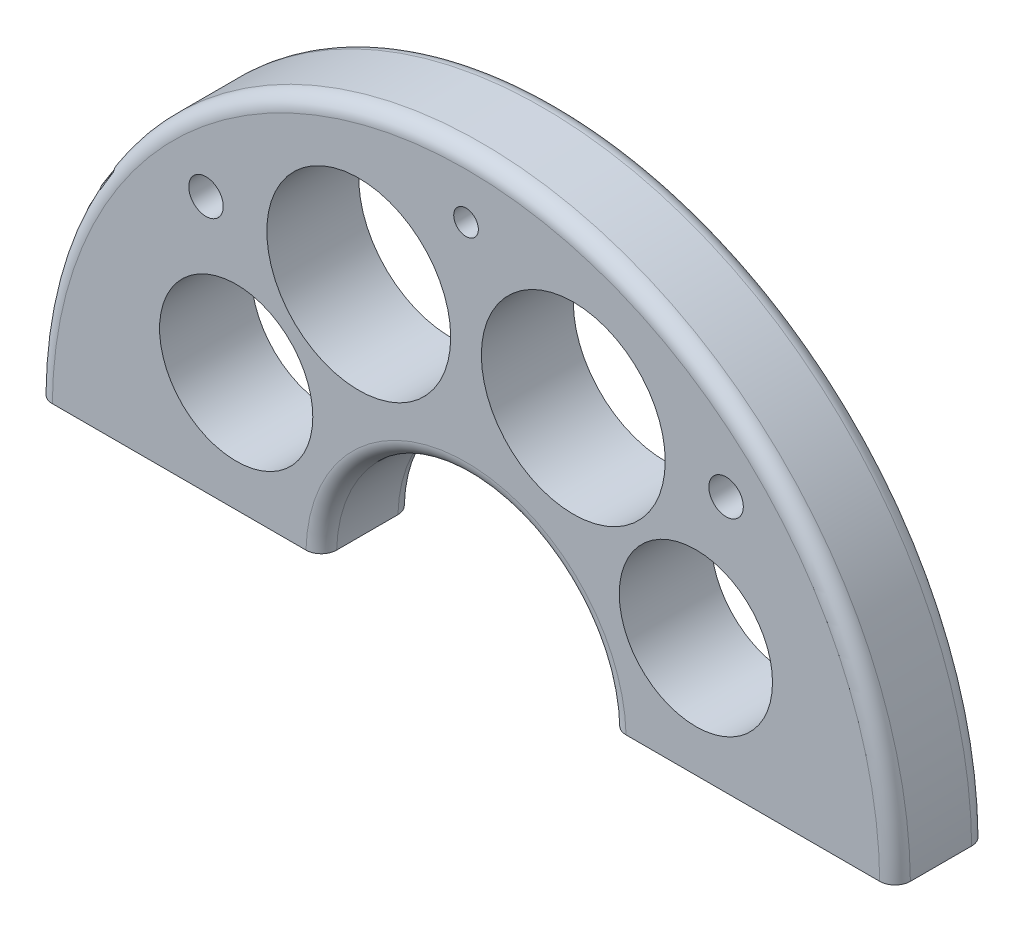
ISO-10303-21;
HEADER;
FILE_DESCRIPTION(('STEP AP214'),'2;1');
FILE_NAME('part.step','',(''),(''),'','','');
FILE_SCHEMA(('AUTOMOTIVE_DESIGN { 1 0 10303 214 1 1 1 1 }'));
ENDSEC;
DATA;
#1=APPLICATION_CONTEXT('core data for automotive mechanical design processes');
#2=APPLICATION_PROTOCOL_DEFINITION('international standard','automotive_design',2000,#1);
#3=PRODUCT_CONTEXT('',#1,'mechanical');
#4=PRODUCT('Part','Part','',(#3));
#5=PRODUCT_RELATED_PRODUCT_CATEGORY('part','',(#4));
#6=PRODUCT_DEFINITION_FORMATION('','',#4);
#7=PRODUCT_DEFINITION_CONTEXT('part definition',#1,'design');
#8=PRODUCT_DEFINITION('design','',#6,#7);
#9=PRODUCT_DEFINITION_SHAPE('','',#8);
#10=(LENGTH_UNIT() NAMED_UNIT(*) SI_UNIT(.MILLI.,.METRE.));
#11=(NAMED_UNIT(*) PLANE_ANGLE_UNIT() SI_UNIT($,.RADIAN.));
#12=(NAMED_UNIT(*) SI_UNIT($,.STERADIAN.) SOLID_ANGLE_UNIT());
#13=UNCERTAINTY_MEASURE_WITH_UNIT(LENGTH_MEASURE(1.E-05),#10,'distance_accuracy_value','');
#14=(GEOMETRIC_REPRESENTATION_CONTEXT(3) GLOBAL_UNCERTAINTY_ASSIGNED_CONTEXT((#13)) GLOBAL_UNIT_ASSIGNED_CONTEXT((#10,
#11,#12)) REPRESENTATION_CONTEXT('',''));
#15=CARTESIAN_POINT('',(0.,0.,0.));
#16=DIRECTION('',(0.,0.,1.));
#17=DIRECTION('',(1.,0.,0.));
#18=AXIS2_PLACEMENT_3D('',#15,#16,#17);
#19=CARTESIAN_POINT('',(0.,0.,9.525));
#20=DIRECTION('',(0.,0.,1.));
#21=DIRECTION('',(1.,0.,0.));
#22=AXIS2_PLACEMENT_3D('',#19,#20,#21);
#23=PLANE('',#22);
#24=CARTESIAN_POINT('',(-22.225,53.975,9.525));
#25=DIRECTION('',(0.,0.,1.));
#26=DIRECTION('',(1.,0.,0.));
#27=AXIS2_PLACEMENT_3D('',#24,#25,#26);
#28=CIRCLE('',#27,19.05);
#29=CARTESIAN_POINT('',(-3.175,53.975,9.525));
#30=VERTEX_POINT('',#29);
#31=EDGE_CURVE('E326',#30,#30,#28,.F.);
#32=ORIENTED_EDGE('',*,*,#31,.T.);
#33=EDGE_LOOP('',(#32));
#34=FACE_BOUND('',#33,.T.);
#35=CARTESIAN_POINT('',(-47.625,25.4,9.525));
#36=DIRECTION('',(0.,0.,1.));
#37=DIRECTION('',(1.,0.,0.));
#38=AXIS2_PLACEMENT_3D('',#35,#36,#37);
#39=CIRCLE('',#38,15.875);
#40=CARTESIAN_POINT('',(-31.75,25.4,9.525));
#41=VERTEX_POINT('',#40);
#42=EDGE_CURVE('E330',#41,#41,#39,.F.);
#43=ORIENTED_EDGE('',*,*,#42,.T.);
#44=EDGE_LOOP('',(#43));
#45=FACE_BOUND('',#44,.T.);
#46=CARTESIAN_POINT('',(22.225,53.975,9.525));
#47=DIRECTION('',(0.,0.,1.));
#48=DIRECTION('',(1.,0.,0.));
#49=AXIS2_PLACEMENT_3D('',#46,#47,#48);
#50=CIRCLE('',#49,19.05);
#51=CARTESIAN_POINT('',(41.275,53.975,9.525));
#52=VERTEX_POINT('',#51);
#53=EDGE_CURVE('E334',#52,#52,#50,.T.);
#54=ORIENTED_EDGE('',*,*,#53,.F.);
#55=EDGE_LOOP('',(#54));
#56=FACE_BOUND('',#55,.T.);
#57=CARTESIAN_POINT('',(47.625,25.4,9.525));
#58=DIRECTION('',(0.,0.,1.));
#59=DIRECTION('',(1.,0.,0.));
#60=AXIS2_PLACEMENT_3D('',#57,#58,#59);
#61=CIRCLE('',#60,15.875);
#62=CARTESIAN_POINT('',(63.5,25.4,9.525));
#63=VERTEX_POINT('',#62);
#64=EDGE_CURVE('E338',#63,#63,#61,.T.);
#65=ORIENTED_EDGE('',*,*,#64,.F.);
#66=EDGE_LOOP('',(#65));
#67=FACE_BOUND('',#66,.T.);
#68=CARTESIAN_POINT('',(0.,76.2,9.525));
#69=DIRECTION('',(0.,0.,1.));
#70=DIRECTION('',(1.,0.,0.));
#71=AXIS2_PLACEMENT_3D('',#68,#69,#70);
#72=CIRCLE('',#71,2.5527);
#73=CARTESIAN_POINT('',(2.5527,76.2,9.525));
#74=VERTEX_POINT('',#73);
#75=EDGE_CURVE('E125',#74,#74,#72,.T.);
#76=ORIENTED_EDGE('',*,*,#75,.F.);
#77=EDGE_LOOP('',(#76));
#78=FACE_BOUND('',#77,.T.);
#79=CARTESIAN_POINT('',(-53.8815367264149,53.8815367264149,9.525));
#80=DIRECTION('',(0.,0.,1.));
#81=DIRECTION('',(1.,0.,0.));
#82=AXIS2_PLACEMENT_3D('',#79,#80,#81);
#83=CIRCLE('',#82,3.57124);
#84=CARTESIAN_POINT('',(-50.3102967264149,53.8815367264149,9.525));
#85=VERTEX_POINT('',#84);
#86=EDGE_CURVE('E141',#85,#85,#83,.T.);
#87=ORIENTED_EDGE('',*,*,#86,.F.);
#88=EDGE_LOOP('',(#87));
#89=FACE_BOUND('',#88,.T.);
#90=CARTESIAN_POINT('',(53.8815367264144,53.8815367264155,9.525));
#91=DIRECTION('',(0.,0.,1.));
#92=DIRECTION('',(1.,0.,0.));
#93=AXIS2_PLACEMENT_3D('',#90,#91,#92);
#94=CIRCLE('',#93,3.57124);
#95=CARTESIAN_POINT('',(57.4527767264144,53.8815367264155,9.525));
#96=VERTEX_POINT('',#95);
#97=EDGE_CURVE('E145',#96,#96,#94,.T.);
#98=ORIENTED_EDGE('',*,*,#97,.F.);
#99=EDGE_LOOP('',(#98));
#100=FACE_BOUND('',#99,.T.);
#101=DIRECTION('',(1.,0.,0.));
#102=VECTOR('',#101,1.);
#103=CARTESIAN_POINT('',(0.,0.79375,9.525));
#104=LINE('',#103,#102);
#105=CARTESIAN_POINT('',(33.1655029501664,0.79375,9.525));
#106=VERTEX_POINT('',#105);
#107=CARTESIAN_POINT('',(85.7213251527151,0.79375,9.525));
#108=VERTEX_POINT('',#107);
#109=EDGE_CURVE('E140',#106,#108,#104,.T.);
#110=ORIENTED_EDGE('',*,*,#109,.T.);
#111=CARTESIAN_POINT('',(0.,0.,9.525));
#112=DIRECTION('',(0.,0.,1.));
#113=DIRECTION('',(1.,0.,0.));
#114=AXIS2_PLACEMENT_3D('',#111,#112,#113);
#115=CIRCLE('',#114,85.725);
#116=CARTESIAN_POINT('',(-85.7213251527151,0.79375,9.525));
#117=VERTEX_POINT('',#116);
#118=EDGE_CURVE('E303',#108,#117,#115,.T.);
#119=ORIENTED_EDGE('',*,*,#118,.T.);
#120=DIRECTION('',(1.,0.,0.));
#121=VECTOR('',#120,1.);
#122=CARTESIAN_POINT('',(0.,0.79375,9.525));
#123=LINE('',#122,#121);
#124=CARTESIAN_POINT('',(-33.1655029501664,0.79375,9.525));
#125=VERTEX_POINT('',#124);
#126=EDGE_CURVE('E160',#117,#125,#123,.T.);
#127=ORIENTED_EDGE('',*,*,#126,.T.);
#128=CARTESIAN_POINT('',(0.,0.,9.525));
#129=DIRECTION('',(0.,0.,1.));
#130=DIRECTION('',(1.,0.,0.));
#131=AXIS2_PLACEMENT_3D('',#128,#129,#130);
#132=CIRCLE('',#131,33.175);
#133=EDGE_CURVE('E306',#125,#106,#132,.F.);
#134=ORIENTED_EDGE('',*,*,#133,.T.);
#135=EDGE_LOOP('',(#110,#119,#127,#134));
#136=FACE_BOUND('',#135,.T.);
#137=ADVANCED_FACE('F40',(#34,#45,#56,#67,#78,#89,#100,#136),#23,.T.);
#138=CARTESIAN_POINT('',(0.,0.,-9.525));
#139=DIRECTION('',(0.,0.,1.));
#140=DIRECTION('',(1.,0.,0.));
#141=AXIS2_PLACEMENT_3D('',#138,#139,#140);
#142=PLANE('',#141);
#143=CARTESIAN_POINT('',(-22.225,53.975,-9.525));
#144=DIRECTION('',(0.,0.,1.));
#145=DIRECTION('',(1.,0.,0.));
#146=AXIS2_PLACEMENT_3D('',#143,#144,#145);
#147=CIRCLE('',#146,19.05);
#148=CARTESIAN_POINT('',(-3.175,53.975,-9.525));
#149=VERTEX_POINT('',#148);
#150=EDGE_CURVE('E367',#149,#149,#147,.T.);
#151=ORIENTED_EDGE('',*,*,#150,.T.);
#152=EDGE_LOOP('',(#151));
#153=FACE_BOUND('',#152,.T.);
#154=CARTESIAN_POINT('',(-47.625,25.4,-9.525));
#155=DIRECTION('',(0.,0.,1.));
#156=DIRECTION('',(1.,0.,0.));
#157=AXIS2_PLACEMENT_3D('',#154,#155,#156);
#158=CIRCLE('',#157,15.875);
#159=CARTESIAN_POINT('',(-31.75,25.4,-9.525));
#160=VERTEX_POINT('',#159);
#161=EDGE_CURVE('E363',#160,#160,#158,.T.);
#162=ORIENTED_EDGE('',*,*,#161,.T.);
#163=EDGE_LOOP('',(#162));
#164=FACE_BOUND('',#163,.T.);
#165=CARTESIAN_POINT('',(22.225,53.975,-9.525));
#166=DIRECTION('',(0.,0.,-1.));
#167=DIRECTION('',(-1.,0.,0.));
#168=AXIS2_PLACEMENT_3D('',#165,#166,#167);
#169=CIRCLE('',#168,19.05);
#170=CARTESIAN_POINT('',(3.175,53.975,-9.525));
#171=VERTEX_POINT('',#170);
#172=EDGE_CURVE('E357',#171,#171,#169,.T.);
#173=ORIENTED_EDGE('',*,*,#172,.F.);
#174=EDGE_LOOP('',(#173));
#175=FACE_BOUND('',#174,.T.);
#176=CARTESIAN_POINT('',(47.625,25.4,-9.525));
#177=DIRECTION('',(0.,0.,-1.));
#178=DIRECTION('',(-1.,0.,0.));
#179=AXIS2_PLACEMENT_3D('',#176,#177,#178);
#180=CIRCLE('',#179,15.875);
#181=CARTESIAN_POINT('',(31.75,25.4,-9.525));
#182=VERTEX_POINT('',#181);
#183=EDGE_CURVE('E354',#182,#182,#180,.T.);
#184=ORIENTED_EDGE('',*,*,#183,.F.);
#185=EDGE_LOOP('',(#184));
#186=FACE_BOUND('',#185,.T.);
#187=CARTESIAN_POINT('',(0.,76.2,-9.525));
#188=DIRECTION('',(0.,0.,-1.));
#189=DIRECTION('',(-1.,0.,0.));
#190=AXIS2_PLACEMENT_3D('',#187,#188,#189);
#191=CIRCLE('',#190,2.5527);
#192=CARTESIAN_POINT('',(-2.5527,76.2,-9.525));
#193=VERTEX_POINT('',#192);
#194=EDGE_CURVE('E348',#193,#193,#191,.T.);
#195=ORIENTED_EDGE('',*,*,#194,.F.);
#196=EDGE_LOOP('',(#195));
#197=FACE_BOUND('',#196,.T.);
#198=CARTESIAN_POINT('',(-53.8815367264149,53.8815367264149,-9.525));
#199=DIRECTION('',(0.,0.,1.));
#200=DIRECTION('',(1.,0.,0.));
#201=AXIS2_PLACEMENT_3D('',#198,#199,#200);
#202=CIRCLE('',#201,3.57124);
#203=CARTESIAN_POINT('',(-50.3102967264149,53.8815367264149,-9.525));
#204=VERTEX_POINT('',#203);
#205=EDGE_CURVE('E135',#204,#204,#202,.T.);
#206=ORIENTED_EDGE('',*,*,#205,.T.);
#207=EDGE_LOOP('',(#206));
#208=FACE_BOUND('',#207,.T.);
#209=CARTESIAN_POINT('',(53.8815367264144,53.8815367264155,-9.525));
#210=DIRECTION('',(0.,0.,1.));
#211=DIRECTION('',(1.,0.,0.));
#212=AXIS2_PLACEMENT_3D('',#209,#210,#211);
#213=CIRCLE('',#212,3.57124);
#214=CARTESIAN_POINT('',(57.4527767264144,53.8815367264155,-9.525));
#215=VERTEX_POINT('',#214);
#216=EDGE_CURVE('E139',#215,#215,#213,.T.);
#217=ORIENTED_EDGE('',*,*,#216,.T.);
#218=EDGE_LOOP('',(#217));
#219=FACE_BOUND('',#218,.T.);
#220=DIRECTION('',(1.,0.,0.));
#221=VECTOR('',#220,1.);
#222=CARTESIAN_POINT('',(0.,0.79375,-9.525));
#223=LINE('',#222,#221);
#224=CARTESIAN_POINT('',(-85.7213251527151,0.79375,-9.525));
#225=VERTEX_POINT('',#224);
#226=CARTESIAN_POINT('',(-33.1655029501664,0.79375,-9.525));
#227=VERTEX_POINT('',#226);
#228=EDGE_CURVE('E157',#225,#227,#223,.T.);
#229=ORIENTED_EDGE('',*,*,#228,.F.);
#230=CARTESIAN_POINT('',(0.,0.,-9.525));
#231=DIRECTION('',(0.,0.,1.));
#232=DIRECTION('',(1.,0.,0.));
#233=AXIS2_PLACEMENT_3D('',#230,#231,#232);
#234=CIRCLE('',#233,85.725);
#235=CARTESIAN_POINT('',(85.7213251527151,0.79375,-9.525));
#236=VERTEX_POINT('',#235);
#237=EDGE_CURVE('E272',#225,#236,#234,.F.);
#238=ORIENTED_EDGE('',*,*,#237,.T.);
#239=DIRECTION('',(1.,0.,0.));
#240=VECTOR('',#239,1.);
#241=CARTESIAN_POINT('',(0.,0.79375,-9.525));
#242=LINE('',#241,#240);
#243=CARTESIAN_POINT('',(33.1655029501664,0.79375,-9.525));
#244=VERTEX_POINT('',#243);
#245=EDGE_CURVE('E152',#244,#236,#242,.T.);
#246=ORIENTED_EDGE('',*,*,#245,.F.);
#247=CARTESIAN_POINT('',(0.,0.,-9.525));
#248=DIRECTION('',(0.,0.,1.));
#249=DIRECTION('',(1.,0.,0.));
#250=AXIS2_PLACEMENT_3D('',#247,#248,#249);
#251=CIRCLE('',#250,33.175);
#252=EDGE_CURVE('E270',#244,#227,#251,.T.);
#253=ORIENTED_EDGE('',*,*,#252,.T.);
#254=EDGE_LOOP('',(#229,#238,#246,#253));
#255=FACE_BOUND('',#254,.T.);
#256=ADVANCED_FACE('F283',(#153,#164,#175,#186,#197,#208,#219,#255),#142,.F.);
#257=CARTESIAN_POINT('',(0.,0.,9.525));
#258=DIRECTION('',(0.,0.,-1.));
#259=DIRECTION('',(-1.,0.,0.));
#260=AXIS2_PLACEMENT_3D('',#257,#258,#259);
#261=CYLINDRICAL_SURFACE('',#260,88.9);
#262=CARTESIAN_POINT('',(-76.2,45.7905011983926,5.55624999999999));
#263=CARTESIAN_POINT('',(-76.3565031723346,45.5300642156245,5.55624993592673));
#264=CARTESIAN_POINT('',(-76.5116679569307,45.2688283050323,5.54964535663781));
#265=CARTESIAN_POINT('',(-76.8190327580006,44.7452606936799,5.52381175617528));
#266=CARTESIAN_POINT('',(-76.9712328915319,44.4829290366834,5.50458323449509));
#267=CARTESIAN_POINT('',(-77.2725662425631,43.9573922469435,5.45388659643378));
#268=CARTESIAN_POINT('',(-77.421696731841,43.694186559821,5.42240804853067));
#269=CARTESIAN_POINT('',(-77.716545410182,43.1675761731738,5.34744274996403));
#270=CARTESIAN_POINT('',(-77.8622636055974,42.9041714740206,5.30395602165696));
#271=CARTESIAN_POINT('',(-78.1504187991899,42.3770276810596,5.20490605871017));
#272=CARTESIAN_POINT('',(-78.2928474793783,42.1132892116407,5.14931527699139));
#273=CARTESIAN_POINT('',(-78.573875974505,41.5865977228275,5.0259507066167));
#274=CARTESIAN_POINT('',(-78.7124755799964,41.323644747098,4.95817625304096));
#275=CARTESIAN_POINT('',(-78.9854761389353,40.7994094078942,4.81010731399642));
#276=CARTESIAN_POINT('',(-79.1198809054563,40.5381257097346,4.7298246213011));
#277=CARTESIAN_POINT('',(-79.3843175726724,40.0178117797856,4.5559934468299));
#278=CARTESIAN_POINT('',(-79.514350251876,39.7587811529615,4.46244734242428));
#279=CARTESIAN_POINT('',(-79.7656421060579,39.2521302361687,4.26414347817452));
#280=CARTESIAN_POINT('',(-79.8870487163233,39.0044083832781,4.15983460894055));
#281=CARTESIAN_POINT('',(-80.124962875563,38.5133066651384,3.9361480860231));
#282=CARTESIAN_POINT('',(-80.2414688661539,38.2699281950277,3.81676568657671));
#283=CARTESIAN_POINT('',(-80.468184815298,37.7908844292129,3.5613988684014));
#284=CARTESIAN_POINT('',(-80.5784259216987,37.5551840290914,3.42550952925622));
#285=CARTESIAN_POINT('',(-80.73856640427,37.2090056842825,3.20647195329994));
#286=CARTESIAN_POINT('',(-80.7910579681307,37.0948823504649,3.13095615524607));
#287=CARTESIAN_POINT('',(-80.8940793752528,36.8696791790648,2.974277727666));
#288=CARTESIAN_POINT('',(-80.9446094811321,36.7585989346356,2.89311585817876));
#289=CARTESIAN_POINT('',(-81.0618487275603,36.4995027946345,2.69302461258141));
#290=CARTESIAN_POINT('',(-81.1275623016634,36.3531646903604,2.57130007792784));
#291=CARTESIAN_POINT('',(-81.2536674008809,36.0704242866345,2.3136472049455));
#292=CARTESIAN_POINT('',(-81.3140504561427,35.9340378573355,2.17769698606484));
#293=CARTESIAN_POINT('',(-81.428047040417,35.6749678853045,1.88785082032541));
#294=CARTESIAN_POINT('',(-81.4815890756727,35.5524303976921,1.7337933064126));
#295=CARTESIAN_POINT('',(-81.5779527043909,35.3307540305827,1.40656117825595));
#296=CARTESIAN_POINT('',(-81.6208045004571,35.2315492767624,1.23344246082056));
#297=CARTESIAN_POINT('',(-81.6790084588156,35.0963395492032,0.931241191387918));
#298=CARTESIAN_POINT('',(-81.6987486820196,35.0503356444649,0.80753027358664));
#299=CARTESIAN_POINT('',(-81.7300701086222,34.9772388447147,0.553650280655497));
#300=CARTESIAN_POINT('',(-81.741662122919,34.9501208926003,0.423490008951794));
#301=CARTESIAN_POINT('',(-81.7555574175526,34.9176055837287,0.159069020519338));
#302=CARTESIAN_POINT('',(-81.7578016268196,34.9123463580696,0.0247876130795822));
#303=CARTESIAN_POINT('',(-81.7525643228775,34.9246082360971,-0.242559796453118));
#304=CARTESIAN_POINT('',(-81.7450789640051,34.9421383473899,-0.375625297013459));
#305=CARTESIAN_POINT('',(-81.7220954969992,34.9958547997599,-0.627063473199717));
#306=CARTESIAN_POINT('',(-81.7072068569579,35.0306215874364,-0.745807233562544));
#307=CARTESIAN_POINT('',(-81.6709723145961,35.1150166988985,-0.976760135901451));
#308=CARTESIAN_POINT('',(-81.6496238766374,35.1646508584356,-1.08896669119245));
#309=CARTESIAN_POINT('',(-81.5842211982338,35.3162233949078,-1.3853162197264));
#310=CARTESIAN_POINT('',(-81.534960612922,35.4299121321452,-1.56226151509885));
#311=CARTESIAN_POINT('',(-81.4258217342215,35.6800268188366,-1.89570518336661));
#312=CARTESIAN_POINT('',(-81.3659055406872,35.8165338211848,-2.05212698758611));
#313=CARTESIAN_POINT('',(-81.2411190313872,36.0986634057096,-2.34154454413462));
#314=CARTESIAN_POINT('',(-81.1765275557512,36.2437341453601,-2.47520950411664));
#315=CARTESIAN_POINT('',(-81.0421246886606,36.543276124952,-2.72880090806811));
#316=CARTESIAN_POINT('',(-80.9723083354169,36.6977562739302,-2.84871401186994));
#317=CARTESIAN_POINT('',(-80.8284221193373,37.0135971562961,-3.0769862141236));
#318=CARTESIAN_POINT('',(-80.7543440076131,37.1749710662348,-3.1853216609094));
#319=CARTESIAN_POINT('',(-80.602773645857,37.5024725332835,-3.39173692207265));
#320=CARTESIAN_POINT('',(-80.5252824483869,37.6685986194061,-3.48981986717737));
#321=CARTESIAN_POINT('',(-80.360147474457,38.0197011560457,-3.68550305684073));
#322=CARTESIAN_POINT('',(-80.2722210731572,38.2050185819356,-3.78224921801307));
#323=CARTESIAN_POINT('',(-80.0932309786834,38.5788455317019,-3.96624933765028));
#324=CARTESIAN_POINT('',(-80.0021667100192,38.7673556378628,-4.0535015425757));
#325=CARTESIAN_POINT('',(-79.8171286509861,39.146910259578,-4.21944911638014));
#326=CARTESIAN_POINT('',(-79.7231525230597,39.3379567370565,-4.29813736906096));
#327=CARTESIAN_POINT('',(-79.5325703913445,39.7218606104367,-4.44753124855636));
#328=CARTESIAN_POINT('',(-79.4359640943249,39.914718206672,-4.51823598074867));
#329=CARTESIAN_POINT('',(-79.1421703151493,40.4958681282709,-4.71932595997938));
#330=CARTESIAN_POINT('',(-78.9412629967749,40.8862137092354,-4.83846206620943));
#331=CARTESIAN_POINT('',(-78.5305347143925,41.6696638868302,-5.04913239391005));
#332=CARTESIAN_POINT('',(-78.3207122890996,42.0627689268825,-5.14066207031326));
#333=CARTESIAN_POINT('',(-77.9872304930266,42.6762771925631,-5.26249943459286));
#334=CARTESIAN_POINT('',(-77.8663679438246,42.8964111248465,-5.30200755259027));
#335=CARTESIAN_POINT('',(-77.6222306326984,43.3366203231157,-5.372645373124));
#336=CARTESIAN_POINT('',(-77.4989563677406,43.5566955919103,-5.40377678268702));
#337=CARTESIAN_POINT('',(-77.1255497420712,44.216682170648,-5.48454386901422));
#338=CARTESIAN_POINT('',(-76.871898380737,44.6562349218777,-5.52152870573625));
#339=CARTESIAN_POINT('',(-76.3570813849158,45.530902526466,-5.56000770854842));
#340=CARTESIAN_POINT('',(-76.0959373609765,45.9660260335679,-5.56159533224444));
#341=CARTESIAN_POINT('',(-75.5669748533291,46.8305313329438,-5.52643234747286));
#342=CARTESIAN_POINT('',(-75.2991600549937,47.2599161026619,-5.48970246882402));
#343=CARTESIAN_POINT('',(-74.8761205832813,47.9255473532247,-5.39848927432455));
#344=CARTESIAN_POINT('',(-74.7224237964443,48.1648173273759,-5.35860748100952));
#345=CARTESIAN_POINT('',(-74.4141308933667,48.6397696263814,-5.26389603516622));
#346=CARTESIAN_POINT('',(-74.2595349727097,48.8754526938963,-5.20906952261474));
#347=CARTESIAN_POINT('',(-73.9500567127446,49.3424526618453,-5.08306992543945));
#348=CARTESIAN_POINT('',(-73.7951742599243,49.5737669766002,-5.01188746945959));
#349=CARTESIAN_POINT('',(-73.4861989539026,50.0306360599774,-4.85154581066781));
#350=CARTESIAN_POINT('',(-73.3321059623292,50.25619186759,-4.76238987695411));
#351=CARTESIAN_POINT('',(-73.0557541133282,50.6568258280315,-4.58336252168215));
#352=CARTESIAN_POINT('',(-72.9331207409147,50.8332051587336,-4.49698773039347));
#353=CARTESIAN_POINT('',(-72.6901592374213,51.1800308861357,-4.31003912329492));
#354=CARTESIAN_POINT('',(-72.569831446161,51.3504764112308,-4.20946323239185));
#355=CARTESIAN_POINT('',(-72.3329916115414,51.6835561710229,-3.99297507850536));
#356=CARTESIAN_POINT('',(-72.2164724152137,51.8462053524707,-3.87709390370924));
#357=CARTESIAN_POINT('',(-71.9887547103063,52.1619312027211,-3.62846095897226));
#358=CARTESIAN_POINT('',(-71.8775529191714,52.31501379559,-3.49571978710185));
#359=CARTESIAN_POINT('',(-71.6421061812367,52.6371115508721,-3.18472626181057));
#360=CARTESIAN_POINT('',(-71.5194112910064,52.8036075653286,-3.00262110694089));
#361=CARTESIAN_POINT('',(-71.2899100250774,53.1130471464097,-2.61044746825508));
#362=CARTESIAN_POINT('',(-71.1830844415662,53.2560192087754,-2.40041338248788));
#363=CARTESIAN_POINT('',(-71.0103840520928,53.4859986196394,-1.99464877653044));
#364=CARTESIAN_POINT('',(-70.9405850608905,53.5784777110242,-1.80377248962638));
#365=CARTESIAN_POINT('',(-70.85052381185,53.697446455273,-1.50527698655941));
#366=CARTESIAN_POINT('',(-70.82293823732,53.7338171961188,-1.40372334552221));
#367=CARTESIAN_POINT('',(-70.7731880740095,53.7993265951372,-1.19703992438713));
#368=CARTESIAN_POINT('',(-70.751020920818,53.8284686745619,-1.09191186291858));
#369=CARTESIAN_POINT('',(-70.712428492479,53.8791563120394,-0.87773747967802));
#370=CARTESIAN_POINT('',(-70.6960582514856,53.9006290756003,-0.768663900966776));
#371=CARTESIAN_POINT('',(-70.6697684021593,53.9350934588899,-0.548406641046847));
#372=CARTESIAN_POINT('',(-70.6598487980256,53.9480850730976,-0.437222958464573));
#373=CARTESIAN_POINT('',(-70.6467401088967,53.9652502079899,-0.213842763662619));
#374=CARTESIAN_POINT('',(-70.6435471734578,53.9694287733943,-0.101646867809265));
#375=CARTESIAN_POINT('',(-70.6439727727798,53.9688716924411,0.122701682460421));
#376=CARTESIAN_POINT('',(-70.6475905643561,53.9641370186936,0.234854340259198));
#377=CARTESIAN_POINT('',(-70.6605598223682,53.9471535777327,0.442470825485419));
#378=CARTESIAN_POINT('',(-70.6690431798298,53.936042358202,0.538084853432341));
#379=CARTESIAN_POINT('',(-70.6907975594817,53.9075268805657,0.727829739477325));
#380=CARTESIAN_POINT('',(-70.7040700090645,53.8901207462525,0.821960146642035));
#381=CARTESIAN_POINT('',(-70.7507044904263,53.8289002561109,1.1011904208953));
#382=CARTESIAN_POINT('',(-70.7908919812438,53.7760729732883,1.28325500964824));
#383=CARTESIAN_POINT('',(-70.9010339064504,53.6308105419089,1.68790256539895));
#384=CARTESIAN_POINT('',(-70.9762848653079,53.5312708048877,1.9064523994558));
#385=CARTESIAN_POINT('',(-71.1464973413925,53.3048409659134,2.32042013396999));
#386=CARTESIAN_POINT('',(-71.2414942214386,53.1779017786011,2.51579553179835));
#387=CARTESIAN_POINT('',(-71.4920370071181,52.8408922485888,2.96655844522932));
#388=CARTESIAN_POINT('',(-71.6554844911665,52.6192536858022,3.20888814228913));
#389=CARTESIAN_POINT('',(-71.9136092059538,52.2653290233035,3.53811715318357));
#390=CARTESIAN_POINT('',(-72.0019506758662,52.1435793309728,3.64227843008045));
#391=CARTESIAN_POINT('',(-72.1819914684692,51.8940620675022,3.83997053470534));
#392=CARTESIAN_POINT('',(-72.2736901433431,51.7662956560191,3.93350339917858));
#393=CARTESIAN_POINT('',(-72.5192834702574,51.4221014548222,4.16758686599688));
#394=CARTESIAN_POINT('',(-72.6752809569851,51.2014573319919,4.29972976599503));
#395=CARTESIAN_POINT('',(-72.991130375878,50.7501812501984,4.54031773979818));
#396=CARTESIAN_POINT('',(-73.1509848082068,50.5195427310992,4.64874695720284));
#397=CARTESIAN_POINT('',(-73.4726864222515,50.0505275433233,4.84449707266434));
#398=CARTESIAN_POINT('',(-73.6345353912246,49.8121435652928,4.9317973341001));
#399=CARTESIAN_POINT('',(-73.9586430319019,49.3296421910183,5.0872905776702));
#400=CARTESIAN_POINT('',(-74.12090160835,49.0855260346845,5.15548765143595));
#401=CARTESIAN_POINT('',(-74.4455091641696,48.5918080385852,5.27481676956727));
#402=CARTESIAN_POINT('',(-74.6078559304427,48.342188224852,5.32587977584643));
#403=CARTESIAN_POINT('',(-74.9312438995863,47.8393984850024,5.41203931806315));
#404=CARTESIAN_POINT('',(-75.0922850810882,47.5862285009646,5.44713559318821));
#405=CARTESIAN_POINT('',(-75.4124641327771,47.0771776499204,5.50255302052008));
#406=CARTESIAN_POINT('',(-75.571602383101,46.8212973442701,5.52287717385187));
#407=CARTESIAN_POINT('',(-75.8876013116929,46.3073750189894,5.54972679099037));
#408=CARTESIAN_POINT('',(-76.0444616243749,46.0493326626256,5.55625006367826));
#409=CARTESIAN_POINT('',(-76.2,45.7905011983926,5.55624999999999));
#410=B_SPLINE_CURVE_WITH_KNOTS('',3,(#262,#263,#264,#265,#266,#267,#268,#269,#270,#271,#272,
#273,#274,#275,#276,#277,#278,#279,#280,#281,#282,#283,#284,#285,#286,#287,#288,#289,#290,#291,
#292,#293,#294,#295,#296,#297,#298,#299,#300,#301,#302,#303,#304,#305,#306,#307,#308,#309,#310,
#311,#312,#313,#314,#315,#316,#317,#318,#319,#320,#321,#322,#323,#324,#325,#326,#327,#328,#329,
#330,#331,#332,#333,#334,#335,#336,#337,#338,#339,#340,#341,#342,#343,#344,#345,#346,#347,#348,
#349,#350,#351,#352,#353,#354,#355,#356,#357,#358,#359,#360,#361,#362,#363,#364,#365,#366,#367,
#368,#369,#370,#371,#372,#373,#374,#375,#376,#377,#378,#379,#380,#381,#382,#383,#384,#385,#386,
#387,#388,#389,#390,#391,#392,#393,#394,#395,#396,#397,#398,#399,#400,#401,#402,#403,#404,#405,
#406,#407,#408,#409),.UNSPECIFIED.,.T.,.F.,(4,2,2,2,2,2,2,2,2,2,2,2,2,2,2,2,2,2,2,2,2,2,2,2,2,2,
2,2,2,2,2,2,2,2,2,2,2,2,2,2,2,2,2,2,2,2,2,2,2,2,2,2,2,2,2,2,2,2,2,2,2,2,2,2,2,2,2,2,2,2,2,2,2,
4),(0.,0.911453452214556,1.8228708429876,2.73506605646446,3.64725957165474,4.56155122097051,
5.47589278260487,6.38937746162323,7.30269861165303,8.18709531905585,9.07177116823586,
9.95157353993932,10.3911505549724,10.8306685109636,11.4341295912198,12.0385328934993,
12.6488101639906,13.2573432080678,13.6562663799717,14.0546592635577,14.4555659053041,
14.8566310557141,15.2290955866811,15.6017065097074,16.245983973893,16.8926006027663,
17.5143701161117,18.1367377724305,18.7603534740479,19.3837781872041,20.063864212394,
20.7440756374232,21.4248480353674,22.1056966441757,23.4692631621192,24.8330540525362,
25.595575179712,26.3579408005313,27.8830847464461,29.4042014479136,30.9244956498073,
31.785648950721,32.6466214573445,33.5080885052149,34.3693990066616,35.0635578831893,
35.7578182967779,36.4506896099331,37.1431275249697,37.9674568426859,38.7907801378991,
39.457801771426,39.7914673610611,40.1249747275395,40.4615683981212,40.7981622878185,
41.1345634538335,41.4709279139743,41.7604763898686,42.0501112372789,42.6290063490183,
43.3798962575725,44.1321426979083,45.2261224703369,45.7747456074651,46.323263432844,
47.2242462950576,48.1258297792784,49.0282903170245,49.9305574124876,50.8364175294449,
51.7422924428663,52.6479832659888,53.5538178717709),.UNSPECIFIED.);
#411=CARTESIAN_POINT('',(-76.2,45.7905011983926,5.55624999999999));
#412=VERTEX_POINT('',#411);
#413=EDGE_CURVE('E133',#412,#412,#410,.T.);
#414=ORIENTED_EDGE('',*,*,#413,.T.);
#415=EDGE_LOOP('',(#414));
#416=FACE_BOUND('',#415,.T.);
#417=DIRECTION('',(0.,0.,1.));
#418=VECTOR('',#417,1.);
#419=CARTESIAN_POINT('',(88.8964564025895,0.79375,-9.525));
#420=LINE('',#419,#418);
#421=CARTESIAN_POINT('',(88.8964564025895,0.79375,-6.35));
#422=VERTEX_POINT('',#421);
#423=CARTESIAN_POINT('',(88.8964564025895,0.79375,6.34999999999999));
#424=VERTEX_POINT('',#423);
#425=EDGE_CURVE('E154',#422,#424,#420,.T.);
#426=ORIENTED_EDGE('',*,*,#425,.F.);
#427=CARTESIAN_POINT('',(0.,0.,-6.35));
#428=DIRECTION('',(0.,0.,1.));
#429=DIRECTION('',(1.,0.,0.));
#430=AXIS2_PLACEMENT_3D('',#427,#428,#429);
#431=CIRCLE('',#430,88.9);
#432=CARTESIAN_POINT('',(-88.8964564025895,0.79375,-6.35));
#433=VERTEX_POINT('',#432);
#434=EDGE_CURVE('E286',#422,#433,#431,.T.);
#435=ORIENTED_EDGE('',*,*,#434,.T.);
#436=DIRECTION('',(0.,0.,1.));
#437=VECTOR('',#436,1.);
#438=CARTESIAN_POINT('',(-88.8964564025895,0.79375,-9.525));
#439=LINE('',#438,#437);
#440=CARTESIAN_POINT('',(-88.8964564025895,0.79375,6.34999999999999));
#441=VERTEX_POINT('',#440);
#442=EDGE_CURVE('E149',#433,#441,#439,.T.);
#443=ORIENTED_EDGE('',*,*,#442,.T.);
#444=CARTESIAN_POINT('',(0.,0.,6.35));
#445=DIRECTION('',(0.,0.,1.));
#446=DIRECTION('',(1.,0.,0.));
#447=AXIS2_PLACEMENT_3D('',#444,#445,#446);
#448=CIRCLE('',#447,88.9);
#449=EDGE_CURVE('E168',#441,#424,#448,.F.);
#450=ORIENTED_EDGE('',*,*,#449,.T.);
#451=EDGE_LOOP('',(#426,#435,#443,#450));
#452=FACE_BOUND('',#451,.T.);
#453=ADVANCED_FACE('F182',(#416,#452),#261,.T.);
#454=CARTESIAN_POINT('',(0.,0.,9.525));
#455=DIRECTION('',(0.,0.,-1.));
#456=DIRECTION('',(-1.,0.,0.));
#457=AXIS2_PLACEMENT_3D('',#454,#455,#456);
#458=CYLINDRICAL_SURFACE('',#457,30.);
#459=DIRECTION('',(0.,0.,1.));
#460=VECTOR('',#459,1.);
#461=CARTESIAN_POINT('',(29.9894975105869,0.79375,-9.525));
#462=LINE('',#461,#460);
#463=CARTESIAN_POINT('',(29.9894975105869,0.79375,-6.35));
#464=VERTEX_POINT('',#463);
#465=CARTESIAN_POINT('',(29.9894975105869,0.79375,6.34999999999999));
#466=VERTEX_POINT('',#465);
#467=EDGE_CURVE('E146',#464,#466,#462,.T.);
#468=ORIENTED_EDGE('',*,*,#467,.T.);
#469=CARTESIAN_POINT('',(0.,0.,6.35));
#470=DIRECTION('',(0.,0.,1.));
#471=DIRECTION('',(1.,0.,0.));
#472=AXIS2_PLACEMENT_3D('',#469,#470,#471);
#473=CIRCLE('',#472,30.);
#474=CARTESIAN_POINT('',(-29.9894975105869,0.79375,6.34999999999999));
#475=VERTEX_POINT('',#474);
#476=EDGE_CURVE('E11',#466,#475,#473,.T.);
#477=ORIENTED_EDGE('',*,*,#476,.T.);
#478=DIRECTION('',(0.,0.,1.));
#479=VECTOR('',#478,1.);
#480=CARTESIAN_POINT('',(-29.9894975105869,0.79375,-9.525));
#481=LINE('',#480,#479);
#482=CARTESIAN_POINT('',(-29.9894975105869,0.79375,-6.35));
#483=VERTEX_POINT('',#482);
#484=EDGE_CURVE('E165',#483,#475,#481,.T.);
#485=ORIENTED_EDGE('',*,*,#484,.F.);
#486=CARTESIAN_POINT('',(0.,0.,-6.35));
#487=DIRECTION('',(0.,0.,1.));
#488=DIRECTION('',(1.,0.,0.));
#489=AXIS2_PLACEMENT_3D('',#486,#487,#488);
#490=CIRCLE('',#489,30.);
#491=EDGE_CURVE('E49',#483,#464,#490,.F.);
#492=ORIENTED_EDGE('',*,*,#491,.T.);
#493=EDGE_LOOP('',(#468,#477,#485,#492));
#494=FACE_BOUND('',#493,.T.);
#495=ADVANCED_FACE('F199',(#494),#458,.F.);
#496=CARTESIAN_POINT('',(-53.8815367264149,53.8815367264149,9.525));
#497=DIRECTION('',(0.,0.,1.));
#498=DIRECTION('',(1.,0.,0.));
#499=AXIS2_PLACEMENT_3D('',#496,#497,#498);
#500=CYLINDRICAL_SURFACE('',#499,3.57124);
#501=ORIENTED_EDGE('',*,*,#205,.F.);
#502=EDGE_LOOP('',(#501));
#503=FACE_BOUND('',#502,.T.);
#504=ORIENTED_EDGE('',*,*,#86,.T.);
#505=EDGE_LOOP('',(#504));
#506=FACE_BOUND('',#505,.T.);
#507=ADVANCED_FACE('F195',(#503,#506),#500,.F.);
#508=CARTESIAN_POINT('',(53.8815367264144,53.8815367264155,9.525));
#509=DIRECTION('',(0.,0.,1.));
#510=DIRECTION('',(1.,0.,0.));
#511=AXIS2_PLACEMENT_3D('',#508,#509,#510);
#512=CYLINDRICAL_SURFACE('',#511,3.57124);
#513=ORIENTED_EDGE('',*,*,#216,.F.);
#514=EDGE_LOOP('',(#513));
#515=FACE_BOUND('',#514,.T.);
#516=ORIENTED_EDGE('',*,*,#97,.T.);
#517=EDGE_LOOP('',(#516));
#518=FACE_BOUND('',#517,.T.);
#519=ADVANCED_FACE('F198',(#515,#518),#512,.F.);
#520=CARTESIAN_POINT('',(0.,0.79375,-9.525));
#521=DIRECTION('',(0.,-1.,0.));
#522=DIRECTION('',(0.,0.,-1.));
#523=AXIS2_PLACEMENT_3D('',#520,#521,#522);
#524=PLANE('',#523);
#525=CARTESIAN_POINT('',(76.2,0.79375,0.));
#526=DIRECTION('',(0.,-1.,0.));
#527=DIRECTION('',(0.,0.,-1.));
#528=AXIS2_PLACEMENT_3D('',#525,#526,#527);
#529=CIRCLE('',#528,2.55270000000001);
#530=CARTESIAN_POINT('',(76.2,0.79375,-2.55270000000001));
#531=VERTEX_POINT('',#530);
#532=EDGE_CURVE('E119',#531,#531,#529,.T.);
#533=ORIENTED_EDGE('',*,*,#532,.F.);
#534=EDGE_LOOP('',(#533));
#535=FACE_BOUND('',#534,.T.);
#536=ORIENTED_EDGE('',*,*,#245,.T.);
#537=CARTESIAN_POINT('',(85.7213251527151,0.79375,-9.525));
#538=CARTESIAN_POINT('',(85.8106335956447,0.79375,-9.52500855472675));
#539=CARTESIAN_POINT('',(85.8999379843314,0.79375,-9.52123216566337));
#540=CARTESIAN_POINT('',(86.0779078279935,0.79375,-9.50617569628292));
#541=CARTESIAN_POINT('',(86.166573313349,0.79375,-9.49489597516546));
#542=CARTESIAN_POINT('',(86.3425768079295,0.79375,-9.46491033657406));
#543=CARTESIAN_POINT('',(86.429915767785,0.79375,-9.44621002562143));
#544=CARTESIAN_POINT('',(86.6026866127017,0.79375,-9.40153485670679));
#545=CARTESIAN_POINT('',(86.6881185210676,0.79375,-9.37556008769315));
#546=CARTESIAN_POINT('',(86.9407294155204,0.79375,-9.28693383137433));
#547=CARTESIAN_POINT('',(87.1042951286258,0.79375,-9.21356813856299));
#548=CARTESIAN_POINT('',(87.4166672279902,0.79375,-9.0404657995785));
#549=CARTESIAN_POINT('',(87.5654762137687,0.79375,-8.94073380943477));
#550=CARTESIAN_POINT('',(87.8442596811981,0.79375,-8.71769847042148));
#551=CARTESIAN_POINT('',(87.9742347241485,0.79375,-8.59439582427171));
#552=CARTESIAN_POINT('',(88.2116577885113,0.79375,-8.32769255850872));
#553=CARTESIAN_POINT('',(88.3191013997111,0.79375,-8.18428801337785));
#554=CARTESIAN_POINT('',(88.5083987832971,0.79375,-7.88146629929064));
#555=CARTESIAN_POINT('',(88.5902485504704,0.79375,-7.7220466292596));
#556=CARTESIAN_POINT('',(88.7259780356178,0.79375,-7.39175980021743));
#557=CARTESIAN_POINT('',(88.7798741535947,0.79375,-7.22089941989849));
#558=CARTESIAN_POINT('',(88.8447683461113,0.79375,-6.93249396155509));
#559=CARTESIAN_POINT('',(88.8641396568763,0.79375,-6.81676362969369));
#560=CARTESIAN_POINT('',(88.8899819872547,0.79375,-6.58403837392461));
#561=CARTESIAN_POINT('',(88.8964712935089,0.79375,-6.46704548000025));
#562=CARTESIAN_POINT('',(88.8964564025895,0.79375,-6.35));
#563=B_SPLINE_CURVE_WITH_KNOTS('',3,(#537,#538,#539,#540,#541,#542,#543,#544,#545,#546,#547,
#548,#549,#550,#551,#552,#553,#554,#555,#556,#557,#558,#559,#560,#561,#562),.UNSPECIFIED.,.F.,
.F.,(4,2,2,2,2,2,2,2,2,2,2,2,4),(0.,0.267838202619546,0.535663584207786,0.803286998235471,
1.07090714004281,1.60593236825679,2.14086317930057,2.67577804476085,3.21079751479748,
3.74590066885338,4.28068952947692,4.63204294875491,4.98289724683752),.UNSPECIFIED.);
#564=EDGE_CURVE('E233',#236,#422,#563,.T.);
#565=ORIENTED_EDGE('',*,*,#564,.T.);
#566=ORIENTED_EDGE('',*,*,#425,.T.);
#567=CARTESIAN_POINT('',(88.8964564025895,0.79375,6.35));
#568=CARTESIAN_POINT('',(88.8964649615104,0.79375,6.43929939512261));
#569=CARTESIAN_POINT('',(88.8926888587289,0.79375,6.52859473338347));
#570=CARTESIAN_POINT('',(88.8776335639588,0.79375,6.70654649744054));
#571=CARTESIAN_POINT('',(88.8663547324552,0.79375,6.79520295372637));
#572=CARTESIAN_POINT('',(88.8363715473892,0.79375,6.97118826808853));
#573=CARTESIAN_POINT('',(88.8176728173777,0.79375,7.05851807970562));
#574=CARTESIAN_POINT('',(88.7730015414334,0.79375,7.23127078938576));
#575=CARTESIAN_POINT('',(88.7470290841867,0.79375,7.31669371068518));
#576=CARTESIAN_POINT('',(88.6584110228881,0.79375,7.56927784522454));
#577=CARTESIAN_POINT('',(88.5850524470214,0.79375,7.73282613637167));
#578=CARTESIAN_POINT('',(88.4119681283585,0.79375,8.04516555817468));
#579=CARTESIAN_POINT('',(88.3122470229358,0.79375,8.19395927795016));
#580=CARTESIAN_POINT('',(88.089233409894,0.79375,8.47272103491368));
#581=CARTESIAN_POINT('',(87.9659407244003,0.79375,8.60268893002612));
#582=CARTESIAN_POINT('',(87.6992599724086,0.79375,8.84010139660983));
#583=CARTESIAN_POINT('',(87.5558679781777,0.79375,8.94754155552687));
#584=CARTESIAN_POINT('',(87.2530617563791,0.79375,9.13684472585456));
#585=CARTESIAN_POINT('',(87.0936437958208,0.79375,9.21870175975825));
#586=CARTESIAN_POINT('',(86.7633597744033,0.79375,9.35444826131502));
#587=CARTESIAN_POINT('',(86.5925004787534,0.79375,9.40835409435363));
#588=CARTESIAN_POINT('',(86.304051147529,0.79375,9.47327694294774));
#589=CARTESIAN_POINT('',(86.1882751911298,0.79375,9.49266137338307));
#590=CARTESIAN_POINT('',(85.9554573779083,0.79375,9.51852121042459));
#591=CARTESIAN_POINT('',(85.8384175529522,0.79375,9.5250149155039));
#592=CARTESIAN_POINT('',(85.7213251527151,0.79375,9.525));
#593=B_SPLINE_CURVE_WITH_KNOTS('',3,(#567,#568,#569,#570,#571,#572,#573,#574,#575,#576,#577,
#578,#579,#580,#581,#582,#583,#584,#585,#586,#587,#588,#589,#590,#591,#592),.UNSPECIFIED.,.F.,
.F.,(4,2,2,2,2,2,2,2,2,2,2,2,4),(0.,0.267811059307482,0.535609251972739,0.803204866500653,
1.0707972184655,1.60576641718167,2.14064157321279,2.67552076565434,3.21050462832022,
3.74561339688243,4.2804085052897,4.63190272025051,4.98289762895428),.UNSPECIFIED.);
#594=EDGE_CURVE('E227',#424,#108,#593,.T.);
#595=ORIENTED_EDGE('',*,*,#594,.T.);
#596=ORIENTED_EDGE('',*,*,#109,.F.);
#597=CARTESIAN_POINT('',(33.1655029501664,0.79375,9.525));
#598=CARTESIAN_POINT('',(33.076153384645,0.79375,9.52500854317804));
#599=CARTESIAN_POINT('',(32.9868078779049,0.79375,9.52123053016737));
#600=CARTESIAN_POINT('',(32.8087560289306,0.79375,9.50616761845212));
#601=CARTESIAN_POINT('',(32.7200496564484,0.79375,9.49488307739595));
#602=CARTESIAN_POINT('',(32.5439643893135,0.79375,9.46488455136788));
#603=CARTESIAN_POINT('',(32.456584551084,0.79375,9.44617613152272));
#604=CARTESIAN_POINT('',(32.2837327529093,0.79375,9.40148145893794));
#605=CARTESIAN_POINT('',(32.1982607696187,0.79375,9.37549529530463));
#606=CARTESIAN_POINT('',(31.9455310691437,0.79375,9.28682970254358));
#607=CARTESIAN_POINT('',(31.7818882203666,0.79375,9.21343094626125));
#608=CARTESIAN_POINT('',(31.4693700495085,0.79375,9.04024787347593));
#609=CARTESIAN_POINT('',(31.3204921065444,0.79375,8.94046825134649));
#610=CARTESIAN_POINT('',(31.0415955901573,0.79375,8.71733160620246));
#611=CARTESIAN_POINT('',(30.9115748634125,0.79375,8.59397727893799));
#612=CARTESIAN_POINT('',(30.6740760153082,0.79375,8.32715873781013));
#613=CARTESIAN_POINT('',(30.5666022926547,0.79375,8.18369060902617));
#614=CARTESIAN_POINT('',(30.3772906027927,0.79375,7.88076988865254));
#615=CARTESIAN_POINT('',(30.2954502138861,0.79375,7.72131880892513));
#616=CARTESIAN_POINT('',(30.1597533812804,0.79375,7.39096874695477));
#617=CARTESIAN_POINT('',(30.1058804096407,0.79375,7.22007659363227));
#618=CARTESIAN_POINT('',(30.041073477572,0.79375,6.9317773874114));
#619=CARTESIAN_POINT('',(30.021744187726,0.79375,6.81618785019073));
#620=CARTESIAN_POINT('',(29.995957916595,0.79375,6.583748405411));
#621=CARTESIAN_POINT('',(29.9894826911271,0.79375,6.46690052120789));
#622=CARTESIAN_POINT('',(29.9894975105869,0.79375,6.35));
#623=B_SPLINE_CURVE_WITH_KNOTS('',3,(#597,#598,#599,#600,#601,#602,#603,#604,#605,#606,#607,
#608,#609,#610,#611,#612,#613,#614,#615,#616,#617,#618,#619,#620,#621,#622),.UNSPECIFIED.,.F.,
.F.,(4,2,2,2,2,2,2,2,2,2,2,2,4),(0.,0.267961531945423,0.535910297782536,0.803658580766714,
1.0714035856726,1.60667907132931,2.14185937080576,2.67697850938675,3.21220194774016,
3.74737480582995,4.28223103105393,4.63314933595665,4.98356921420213),.UNSPECIFIED.);
#624=EDGE_CURVE('E56',#106,#466,#623,.T.);
#625=ORIENTED_EDGE('',*,*,#624,.T.);
#626=ORIENTED_EDGE('',*,*,#467,.F.);
#627=CARTESIAN_POINT('',(29.9894975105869,0.79375,-6.35));
#628=CARTESIAN_POINT('',(29.9894889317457,0.79375,-6.43927998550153));
#629=CARTESIAN_POINT('',(29.9932645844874,0.79375,-6.52855590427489));
#630=CARTESIAN_POINT('',(30.0083179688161,0.79375,-6.70646879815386));
#631=CARTESIAN_POINT('',(30.0195953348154,0.79375,-6.79510580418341));
#632=CARTESIAN_POINT('',(30.0495742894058,0.79375,-6.97105148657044));
#633=CARTESIAN_POINT('',(30.0682701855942,0.79375,-7.05836112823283));
#634=CARTESIAN_POINT('',(30.1129342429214,0.79375,-7.23107378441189));
#635=CARTESIAN_POINT('',(30.1389023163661,0.79375,-7.3164768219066));
#636=CARTESIAN_POINT('',(30.2275042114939,0.79375,-7.56900142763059));
#637=CARTESIAN_POINT('',(30.3008480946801,0.79375,-7.73251079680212));
#638=CARTESIAN_POINT('',(30.4738928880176,0.79375,-8.04477825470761));
#639=CARTESIAN_POINT('',(30.5735892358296,0.79375,-8.19353889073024));
#640=CARTESIAN_POINT('',(30.796557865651,0.79375,-8.47226574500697));
#641=CARTESIAN_POINT('',(30.9198337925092,0.79375,-8.60222905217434));
#642=CARTESIAN_POINT('',(31.1864748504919,0.79375,-8.83964241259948));
#643=CARTESIAN_POINT('',(31.3298439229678,0.79375,-8.94708803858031));
#644=CARTESIAN_POINT('',(31.6326428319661,0.79375,-9.1364444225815));
#645=CARTESIAN_POINT('',(31.7920809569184,0.79375,-9.21834191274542));
#646=CARTESIAN_POINT('',(32.1224098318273,0.79375,-9.35417236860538));
#647=CARTESIAN_POINT('',(32.2932938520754,0.79375,-9.40812160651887));
#648=CARTESIAN_POINT('',(32.5819323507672,0.79375,-9.47315168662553));
#649=CARTESIAN_POINT('',(32.6978743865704,0.79375,-9.4925829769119));
#650=CARTESIAN_POINT('',(32.9310290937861,0.79375,-9.51850546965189));
#651=CARTESIAN_POINT('',(33.0482397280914,0.79375,-9.52501499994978));
#652=CARTESIAN_POINT('',(33.1655029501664,0.79375,-9.525));
#653=B_SPLINE_CURVE_WITH_KNOTS('',3,(#627,#628,#629,#630,#631,#632,#633,#634,#635,#636,#637,
#638,#639,#640,#641,#642,#643,#644,#645,#646,#647,#648,#649,#650,#651,#652),.UNSPECIFIED.,.F.,
.F.,(4,2,2,2,2,2,2,2,2,2,2,2,4),(0.,0.267752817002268,0.535492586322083,0.803027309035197,
1.07055880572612,1.60540448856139,2.14015763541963,2.67499350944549,3.20993444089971,
3.74515272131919,4.28005903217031,4.6320654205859,4.98357217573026),.UNSPECIFIED.);
#654=EDGE_CURVE('E213',#464,#244,#653,.T.);
#655=ORIENTED_EDGE('',*,*,#654,.T.);
#656=EDGE_LOOP('',(#536,#565,#566,#595,#596,#625,#626,#655));
#657=FACE_BOUND('',#656,.T.);
#658=ADVANCED_FACE('F203',(#535,#657),#524,.T.);
#659=CARTESIAN_POINT('',(0.,0.79375,-9.525));
#660=DIRECTION('',(0.,-1.,0.));
#661=DIRECTION('',(0.,0.,-1.));
#662=AXIS2_PLACEMENT_3D('',#659,#660,#661);
#663=PLANE('',#662);
#664=CARTESIAN_POINT('',(-76.2,0.793749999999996,0.));
#665=DIRECTION('',(0.,-1.,0.));
#666=DIRECTION('',(0.,0.,-1.));
#667=AXIS2_PLACEMENT_3D('',#664,#665,#666);
#668=CIRCLE('',#667,3.57123999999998);
#669=CARTESIAN_POINT('',(-76.2,0.793749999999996,-3.57123999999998));
#670=VERTEX_POINT('',#669);
#671=EDGE_CURVE('E118',#670,#670,#668,.F.);
#672=ORIENTED_EDGE('',*,*,#671,.T.);
#673=EDGE_LOOP('',(#672));
#674=FACE_BOUND('',#673,.T.);
#675=ORIENTED_EDGE('',*,*,#442,.F.);
#676=CARTESIAN_POINT('',(-88.8964564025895,0.79375,-6.35));
#677=CARTESIAN_POINT('',(-88.8964649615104,0.79375,-6.43929939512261));
#678=CARTESIAN_POINT('',(-88.8926888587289,0.79375,-6.52859473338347));
#679=CARTESIAN_POINT('',(-88.8776335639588,0.79375,-6.70654649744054));
#680=CARTESIAN_POINT('',(-88.8663547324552,0.79375,-6.79520295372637));
#681=CARTESIAN_POINT('',(-88.8363715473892,0.79375,-6.97118826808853));
#682=CARTESIAN_POINT('',(-88.8176728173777,0.79375,-7.05851807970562));
#683=CARTESIAN_POINT('',(-88.7730015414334,0.79375,-7.23127078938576));
#684=CARTESIAN_POINT('',(-88.7470290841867,0.79375,-7.31669371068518));
#685=CARTESIAN_POINT('',(-88.6584110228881,0.79375,-7.56927784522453));
#686=CARTESIAN_POINT('',(-88.5850524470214,0.79375,-7.73282613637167));
#687=CARTESIAN_POINT('',(-88.4119681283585,0.79375,-8.04516555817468));
#688=CARTESIAN_POINT('',(-88.3122470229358,0.79375,-8.19395927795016));
#689=CARTESIAN_POINT('',(-88.089233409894,0.79375,-8.47272103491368));
#690=CARTESIAN_POINT('',(-87.9659407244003,0.79375,-8.60268893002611));
#691=CARTESIAN_POINT('',(-87.6992599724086,0.79375,-8.84010139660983));
#692=CARTESIAN_POINT('',(-87.5558679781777,0.79375,-8.94754155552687));
#693=CARTESIAN_POINT('',(-87.2530617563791,0.79375,-9.13684472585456));
#694=CARTESIAN_POINT('',(-87.0936437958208,0.79375,-9.21870175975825));
#695=CARTESIAN_POINT('',(-86.7633597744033,0.79375,-9.35444826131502));
#696=CARTESIAN_POINT('',(-86.5925004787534,0.79375,-9.40835409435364));
#697=CARTESIAN_POINT('',(-86.304051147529,0.79375,-9.47327694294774));
#698=CARTESIAN_POINT('',(-86.1882751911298,0.79375,-9.49266137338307));
#699=CARTESIAN_POINT('',(-85.9554573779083,0.79375,-9.51852121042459));
#700=CARTESIAN_POINT('',(-85.8384175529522,0.79375,-9.5250149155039));
#701=CARTESIAN_POINT('',(-85.721325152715,0.79375,-9.525));
#702=B_SPLINE_CURVE_WITH_KNOTS('',3,(#676,#677,#678,#679,#680,#681,#682,#683,#684,#685,#686,
#687,#688,#689,#690,#691,#692,#693,#694,#695,#696,#697,#698,#699,#700,#701),.UNSPECIFIED.,.F.,
.F.,(4,2,2,2,2,2,2,2,2,2,2,2,4),(0.,0.267811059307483,0.535609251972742,0.803204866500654,
1.0707972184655,1.60576641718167,2.14064157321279,2.67552076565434,3.21050462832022,
3.74561339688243,4.28040850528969,4.63190272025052,4.9828976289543),.UNSPECIFIED.);
#703=EDGE_CURVE('E258',#433,#225,#702,.T.);
#704=ORIENTED_EDGE('',*,*,#703,.T.);
#705=ORIENTED_EDGE('',*,*,#228,.T.);
#706=CARTESIAN_POINT('',(-33.1655029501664,0.79375,-9.525));
#707=CARTESIAN_POINT('',(-33.076153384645,0.79375,-9.52500854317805));
#708=CARTESIAN_POINT('',(-32.9868078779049,0.79375,-9.52123053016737));
#709=CARTESIAN_POINT('',(-32.8087560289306,0.79375,-9.50616761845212));
#710=CARTESIAN_POINT('',(-32.7200496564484,0.79375,-9.49488307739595));
#711=CARTESIAN_POINT('',(-32.5439643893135,0.79375,-9.46488455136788));
#712=CARTESIAN_POINT('',(-32.456584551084,0.79375,-9.44617613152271));
#713=CARTESIAN_POINT('',(-32.2837327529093,0.79375,-9.40148145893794));
#714=CARTESIAN_POINT('',(-32.1982607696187,0.79375,-9.37549529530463));
#715=CARTESIAN_POINT('',(-31.9455310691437,0.79375,-9.28682970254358));
#716=CARTESIAN_POINT('',(-31.7818882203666,0.79375,-9.21343094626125));
#717=CARTESIAN_POINT('',(-31.4693700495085,0.79375,-9.04024787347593));
#718=CARTESIAN_POINT('',(-31.3204921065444,0.79375,-8.94046825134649));
#719=CARTESIAN_POINT('',(-31.0415955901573,0.79375,-8.71733160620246));
#720=CARTESIAN_POINT('',(-30.9115748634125,0.79375,-8.59397727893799));
#721=CARTESIAN_POINT('',(-30.6740760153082,0.79375,-8.32715873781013));
#722=CARTESIAN_POINT('',(-30.5666022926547,0.79375,-8.18369060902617));
#723=CARTESIAN_POINT('',(-30.3772906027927,0.79375,-7.88076988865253));
#724=CARTESIAN_POINT('',(-30.2954502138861,0.79375,-7.72131880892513));
#725=CARTESIAN_POINT('',(-30.1597533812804,0.79375,-7.39096874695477));
#726=CARTESIAN_POINT('',(-30.1058804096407,0.79375,-7.22007659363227));
#727=CARTESIAN_POINT('',(-30.041073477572,0.79375,-6.9317773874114));
#728=CARTESIAN_POINT('',(-30.021744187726,0.79375,-6.81618785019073));
#729=CARTESIAN_POINT('',(-29.995957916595,0.79375,-6.583748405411));
#730=CARTESIAN_POINT('',(-29.9894826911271,0.79375,-6.46690052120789));
#731=CARTESIAN_POINT('',(-29.9894975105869,0.79375,-6.35));
#732=B_SPLINE_CURVE_WITH_KNOTS('',3,(#706,#707,#708,#709,#710,#711,#712,#713,#714,#715,#716,
#717,#718,#719,#720,#721,#722,#723,#724,#725,#726,#727,#728,#729,#730,#731),.UNSPECIFIED.,.F.,
.F.,(4,2,2,2,2,2,2,2,2,2,2,2,4),(0.,0.267961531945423,0.535910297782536,0.803658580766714,
1.0714035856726,1.6066790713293,2.14185937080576,2.67697850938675,3.21220194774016,
3.74737480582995,4.28223103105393,4.63314933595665,4.98356921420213),.UNSPECIFIED.);
#733=EDGE_CURVE('E284',#227,#483,#732,.T.);
#734=ORIENTED_EDGE('',*,*,#733,.T.);
#735=ORIENTED_EDGE('',*,*,#484,.T.);
#736=CARTESIAN_POINT('',(-29.9894975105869,0.79375,6.35));
#737=CARTESIAN_POINT('',(-29.9894889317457,0.79375,6.43927998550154));
#738=CARTESIAN_POINT('',(-29.9932645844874,0.79375,6.5285559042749));
#739=CARTESIAN_POINT('',(-30.0083179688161,0.79375,6.70646879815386));
#740=CARTESIAN_POINT('',(-30.0195953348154,0.79375,6.79510580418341));
#741=CARTESIAN_POINT('',(-30.0495742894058,0.79375,6.97105148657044));
#742=CARTESIAN_POINT('',(-30.0682701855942,0.79375,7.05836112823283));
#743=CARTESIAN_POINT('',(-30.1129342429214,0.79375,7.23107378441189));
#744=CARTESIAN_POINT('',(-30.1389023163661,0.79375,7.3164768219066));
#745=CARTESIAN_POINT('',(-30.2275042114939,0.79375,7.56900142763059));
#746=CARTESIAN_POINT('',(-30.3008480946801,0.79375,7.73251079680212));
#747=CARTESIAN_POINT('',(-30.4738928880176,0.79375,8.04477825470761));
#748=CARTESIAN_POINT('',(-30.5735892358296,0.79375,8.19353889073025));
#749=CARTESIAN_POINT('',(-30.796557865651,0.79375,8.47226574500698));
#750=CARTESIAN_POINT('',(-30.9198337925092,0.79375,8.60222905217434));
#751=CARTESIAN_POINT('',(-31.1864748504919,0.79375,8.83964241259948));
#752=CARTESIAN_POINT('',(-31.3298439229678,0.79375,8.94708803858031));
#753=CARTESIAN_POINT('',(-31.6326428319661,0.79375,9.1364444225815));
#754=CARTESIAN_POINT('',(-31.7920809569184,0.79375,9.21834191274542));
#755=CARTESIAN_POINT('',(-32.1224098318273,0.79375,9.35417236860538));
#756=CARTESIAN_POINT('',(-32.2932938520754,0.79375,9.40812160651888));
#757=CARTESIAN_POINT('',(-32.5819323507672,0.79375,9.47315168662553));
#758=CARTESIAN_POINT('',(-32.6978743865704,0.79375,9.4925829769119));
#759=CARTESIAN_POINT('',(-32.9310290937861,0.79375,9.51850546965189));
#760=CARTESIAN_POINT('',(-33.0482397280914,0.79375,9.52501499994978));
#761=CARTESIAN_POINT('',(-33.1655029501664,0.79375,9.525));
#762=B_SPLINE_CURVE_WITH_KNOTS('',3,(#736,#737,#738,#739,#740,#741,#742,#743,#744,#745,#746,
#747,#748,#749,#750,#751,#752,#753,#754,#755,#756,#757,#758,#759,#760,#761),.UNSPECIFIED.,.F.,
.F.,(4,2,2,2,2,2,2,2,2,2,2,2,4),(0.,0.267752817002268,0.535492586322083,0.803027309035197,
1.07055880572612,1.60540448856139,2.14015763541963,2.67499350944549,3.20993444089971,
3.74515272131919,4.28005903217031,4.6320654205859,4.98357217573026),.UNSPECIFIED.);
#763=EDGE_CURVE('E259',#475,#125,#762,.T.);
#764=ORIENTED_EDGE('',*,*,#763,.T.);
#765=ORIENTED_EDGE('',*,*,#126,.F.);
#766=CARTESIAN_POINT('',(-85.7213251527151,0.79375,9.525));
#767=CARTESIAN_POINT('',(-85.8106335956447,0.79375,9.52500855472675));
#768=CARTESIAN_POINT('',(-85.8999379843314,0.79375,9.52123216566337));
#769=CARTESIAN_POINT('',(-86.0779078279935,0.79375,9.50617569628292));
#770=CARTESIAN_POINT('',(-86.166573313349,0.79375,9.49489597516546));
#771=CARTESIAN_POINT('',(-86.3425768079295,0.79375,9.46491033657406));
#772=CARTESIAN_POINT('',(-86.429915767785,0.79375,9.44621002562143));
#773=CARTESIAN_POINT('',(-86.6026866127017,0.79375,9.40153485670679));
#774=CARTESIAN_POINT('',(-86.6881185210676,0.79375,9.37556008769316));
#775=CARTESIAN_POINT('',(-86.9407294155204,0.79375,9.28693383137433));
#776=CARTESIAN_POINT('',(-87.1042951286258,0.79375,9.21356813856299));
#777=CARTESIAN_POINT('',(-87.4166672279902,0.79375,9.0404657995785));
#778=CARTESIAN_POINT('',(-87.5654762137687,0.79375,8.94073380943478));
#779=CARTESIAN_POINT('',(-87.8442596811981,0.79375,8.71769847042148));
#780=CARTESIAN_POINT('',(-87.9742347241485,0.79375,8.59439582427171));
#781=CARTESIAN_POINT('',(-88.2116577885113,0.79375,8.32769255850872));
#782=CARTESIAN_POINT('',(-88.3191013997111,0.79375,8.18428801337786));
#783=CARTESIAN_POINT('',(-88.5083987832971,0.79375,7.88146629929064));
#784=CARTESIAN_POINT('',(-88.5902485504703,0.79375,7.72204662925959));
#785=CARTESIAN_POINT('',(-88.7259780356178,0.79375,7.39175980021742));
#786=CARTESIAN_POINT('',(-88.7798741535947,0.79375,7.22089941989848));
#787=CARTESIAN_POINT('',(-88.8447683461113,0.79375,6.93249396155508));
#788=CARTESIAN_POINT('',(-88.8641396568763,0.79375,6.81676362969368));
#789=CARTESIAN_POINT('',(-88.8899819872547,0.79375,6.5840383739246));
#790=CARTESIAN_POINT('',(-88.8964712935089,0.79375,6.46704548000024));
#791=CARTESIAN_POINT('',(-88.8964564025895,0.79375,6.35));
#792=B_SPLINE_CURVE_WITH_KNOTS('',3,(#766,#767,#768,#769,#770,#771,#772,#773,#774,#775,#776,
#777,#778,#779,#780,#781,#782,#783,#784,#785,#786,#787,#788,#789,#790,#791),.UNSPECIFIED.,.F.,
.F.,(4,2,2,2,2,2,2,2,2,2,2,2,4),(0.,0.267838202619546,0.535663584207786,0.80328699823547,
1.07090714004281,1.60593236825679,2.14086317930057,2.67577804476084,3.21079751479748,
3.74590066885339,4.28068952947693,4.63204294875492,4.98289724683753),.UNSPECIFIED.);
#793=EDGE_CURVE('E251',#117,#441,#792,.T.);
#794=ORIENTED_EDGE('',*,*,#793,.T.);
#795=EDGE_LOOP('',(#675,#704,#705,#734,#735,#764,#765,#794));
#796=FACE_BOUND('',#795,.T.);
#797=ADVANCED_FACE('F192',(#674,#796),#663,.T.);
#798=CARTESIAN_POINT('',(-76.2,88.9,0.));
#799=DIRECTION('',(0.,1.,0.));
#800=DIRECTION('',(0.,0.,1.));
#801=AXIS2_PLACEMENT_3D('',#798,#799,#800);
#802=CYLINDRICAL_SURFACE('',#801,5.55624999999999);
#803=CARTESIAN_POINT('',(-76.2,12.7,0.));
#804=DIRECTION('',(0.,1.,0.));
#805=DIRECTION('',(0.,0.,1.));
#806=AXIS2_PLACEMENT_3D('',#803,#804,#805);
#807=CIRCLE('',#806,5.55624999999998);
#808=CARTESIAN_POINT('',(-76.2,12.7,5.55624999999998));
#809=VERTEX_POINT('',#808);
#810=EDGE_CURVE('E131',#809,#809,#807,.T.);
#811=ORIENTED_EDGE('',*,*,#810,.F.);
#812=EDGE_LOOP('',(#811));
#813=FACE_BOUND('',#812,.T.);
#814=ORIENTED_EDGE('',*,*,#413,.F.);
#815=EDGE_LOOP('',(#814));
#816=FACE_BOUND('',#815,.T.);
#817=ADVANCED_FACE('F186',(#813,#816),#802,.F.);
#818=CARTESIAN_POINT('',(-76.2,88.9,0.));
#819=DIRECTION('',(0.,1.,0.));
#820=DIRECTION('',(0.,0.,1.));
#821=AXIS2_PLACEMENT_3D('',#818,#819,#820);
#822=CYLINDRICAL_SURFACE('',#821,3.57123999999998);
#823=ORIENTED_EDGE('',*,*,#671,.F.);
#824=EDGE_LOOP('',(#823));
#825=FACE_BOUND('',#824,.T.);
#826=CARTESIAN_POINT('',(-76.2,12.7,0.));
#827=DIRECTION('',(0.,1.,0.));
#828=DIRECTION('',(0.,0.,1.));
#829=AXIS2_PLACEMENT_3D('',#826,#827,#828);
#830=CIRCLE('',#829,3.57123999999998);
#831=CARTESIAN_POINT('',(-76.2,12.7,3.57123999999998));
#832=VERTEX_POINT('',#831);
#833=EDGE_CURVE('E122',#832,#832,#830,.T.);
#834=ORIENTED_EDGE('',*,*,#833,.T.);
#835=EDGE_LOOP('',(#834));
#836=FACE_BOUND('',#835,.T.);
#837=ADVANCED_FACE('F191',(#825,#836),#822,.F.);
#838=CARTESIAN_POINT('',(-72.62876,12.7,0.));
#839=DIRECTION('',(0.,-1.,0.));
#840=DIRECTION('',(0.,0.,-1.));
#841=AXIS2_PLACEMENT_3D('',#838,#839,#840);
#842=PLANE('',#841);
#843=ORIENTED_EDGE('',*,*,#833,.F.);
#844=EDGE_LOOP('',(#843));
#845=FACE_BOUND('',#844,.T.);
#846=ORIENTED_EDGE('',*,*,#810,.T.);
#847=EDGE_LOOP('',(#846));
#848=FACE_BOUND('',#847,.T.);
#849=ADVANCED_FACE('F112',(#845,#848),#842,.F.);
#850=CARTESIAN_POINT('',(76.2,35.71875,0.));
#851=DIRECTION('',(0.,-1.,0.));
#852=DIRECTION('',(0.,0.,-1.));
#853=AXIS2_PLACEMENT_3D('',#850,#851,#852);
#854=CONICAL_SURFACE('',#853,2.55269999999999,1.02974425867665);
#855=CARTESIAN_POINT('',(76.2,37.2525669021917,0.));
#856=VERTEX_POINT('',#855);
#857=VERTEX_LOOP('',#856);
#858=FACE_BOUND('',#857,.T.);
#859=CARTESIAN_POINT('',(76.2,35.71875,0.));
#860=DIRECTION('',(0.,-1.,0.));
#861=DIRECTION('',(0.,0.,-1.));
#862=AXIS2_PLACEMENT_3D('',#859,#860,#861);
#863=CIRCLE('',#862,2.55269999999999);
#864=CARTESIAN_POINT('',(76.2,35.71875,-2.55269999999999));
#865=VERTEX_POINT('',#864);
#866=EDGE_CURVE('E116',#865,#865,#863,.T.);
#867=ORIENTED_EDGE('',*,*,#866,.T.);
#868=EDGE_LOOP('',(#867));
#869=FACE_BOUND('',#868,.T.);
#870=ADVANCED_FACE('F108',(#858,#869),#854,.F.);
#871=CARTESIAN_POINT('',(76.2,0.79375,0.));
#872=DIRECTION('',(0.,-1.,0.));
#873=DIRECTION('',(0.,0.,-1.));
#874=AXIS2_PLACEMENT_3D('',#871,#872,#873);
#875=CYLINDRICAL_SURFACE('',#874,2.5527);
#876=ORIENTED_EDGE('',*,*,#866,.F.);
#877=EDGE_LOOP('',(#876));
#878=FACE_BOUND('',#877,.T.);
#879=ORIENTED_EDGE('',*,*,#532,.T.);
#880=EDGE_LOOP('',(#879));
#881=FACE_BOUND('',#880,.T.);
#882=ADVANCED_FACE('F111',(#878,#881),#875,.F.);
#883=CARTESIAN_POINT('',(0.,0.,-6.35));
#884=DIRECTION('',(0.,0.,1.));
#885=DIRECTION('',(1.,0.,0.));
#886=AXIS2_PLACEMENT_3D('',#883,#884,#885);
#887=TOROIDAL_SURFACE('',#886,85.725,3.175);
#888=ORIENTED_EDGE('',*,*,#564,.F.);
#889=ORIENTED_EDGE('',*,*,#237,.F.);
#890=ORIENTED_EDGE('',*,*,#703,.F.);
#891=ORIENTED_EDGE('',*,*,#434,.F.);
#892=EDGE_LOOP('',(#888,#889,#890,#891));
#893=FACE_BOUND('',#892,.T.);
#894=ADVANCED_FACE('F244',(#893),#887,.T.);
#895=CARTESIAN_POINT('',(0.,0.,6.35));
#896=DIRECTION('',(0.,0.,1.));
#897=DIRECTION('',(1.,0.,0.));
#898=AXIS2_PLACEMENT_3D('',#895,#896,#897);
#899=TOROIDAL_SURFACE('',#898,85.725,3.175);
#900=ORIENTED_EDGE('',*,*,#594,.F.);
#901=ORIENTED_EDGE('',*,*,#449,.F.);
#902=ORIENTED_EDGE('',*,*,#793,.F.);
#903=ORIENTED_EDGE('',*,*,#118,.F.);
#904=EDGE_LOOP('',(#900,#901,#902,#903));
#905=FACE_BOUND('',#904,.T.);
#906=ADVANCED_FACE('F240',(#905),#899,.T.);
#907=CARTESIAN_POINT('',(0.,0.,6.35));
#908=DIRECTION('',(0.,0.,1.));
#909=DIRECTION('',(1.,0.,0.));
#910=AXIS2_PLACEMENT_3D('',#907,#908,#909);
#911=TOROIDAL_SURFACE('',#910,33.175,3.175);
#912=ORIENTED_EDGE('',*,*,#624,.F.);
#913=ORIENTED_EDGE('',*,*,#133,.F.);
#914=ORIENTED_EDGE('',*,*,#763,.F.);
#915=ORIENTED_EDGE('',*,*,#476,.F.);
#916=EDGE_LOOP('',(#912,#913,#914,#915));
#917=FACE_BOUND('',#916,.T.);
#918=ADVANCED_FACE('F243',(#917),#911,.T.);
#919=CARTESIAN_POINT('',(0.,0.,-6.35));
#920=DIRECTION('',(0.,0.,1.));
#921=DIRECTION('',(1.,0.,0.));
#922=AXIS2_PLACEMENT_3D('',#919,#920,#921);
#923=TOROIDAL_SURFACE('',#922,33.175,3.175);
#924=ORIENTED_EDGE('',*,*,#654,.F.);
#925=ORIENTED_EDGE('',*,*,#491,.F.);
#926=ORIENTED_EDGE('',*,*,#733,.F.);
#927=ORIENTED_EDGE('',*,*,#252,.F.);
#928=EDGE_LOOP('',(#924,#925,#926,#927));
#929=FACE_BOUND('',#928,.T.);
#930=ADVANCED_FACE('F42',(#929),#923,.T.);
#931=CARTESIAN_POINT('',(0.,76.2,-9.525));
#932=DIRECTION('',(0.,0.,-1.));
#933=DIRECTION('',(-1.,0.,0.));
#934=AXIS2_PLACEMENT_3D('',#931,#932,#933);
#935=CYLINDRICAL_SURFACE('',#934,2.5527);
#936=ORIENTED_EDGE('',*,*,#75,.T.);
#937=EDGE_LOOP('',(#936));
#938=FACE_BOUND('',#937,.T.);
#939=ORIENTED_EDGE('',*,*,#194,.T.);
#940=EDGE_LOOP('',(#939));
#941=FACE_BOUND('',#940,.T.);
#942=ADVANCED_FACE('F391',(#938,#941),#935,.F.);
#943=CARTESIAN_POINT('',(47.625,25.4,9.70412012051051));
#944=DIRECTION('',(0.,0.,-1.));
#945=DIRECTION('',(-1.,0.,0.));
#946=AXIS2_PLACEMENT_3D('',#943,#944,#945);
#947=CYLINDRICAL_SURFACE('',#946,15.875);
#948=ORIENTED_EDGE('',*,*,#64,.T.);
#949=EDGE_LOOP('',(#948));
#950=FACE_BOUND('',#949,.T.);
#951=ORIENTED_EDGE('',*,*,#183,.T.);
#952=EDGE_LOOP('',(#951));
#953=FACE_BOUND('',#952,.T.);
#954=ADVANCED_FACE('F387',(#950,#953),#947,.F.);
#955=CARTESIAN_POINT('',(22.225,53.975,9.70412012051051));
#956=DIRECTION('',(0.,0.,-1.));
#957=DIRECTION('',(-1.,0.,0.));
#958=AXIS2_PLACEMENT_3D('',#955,#956,#957);
#959=CYLINDRICAL_SURFACE('',#958,19.05);
#960=ORIENTED_EDGE('',*,*,#53,.T.);
#961=EDGE_LOOP('',(#960));
#962=FACE_BOUND('',#961,.T.);
#963=ORIENTED_EDGE('',*,*,#172,.T.);
#964=EDGE_LOOP('',(#963));
#965=FACE_BOUND('',#964,.T.);
#966=ADVANCED_FACE('F381',(#962,#965),#959,.F.);
#967=CARTESIAN_POINT('',(-47.625,25.4,9.70412012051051));
#968=DIRECTION('',(0.,0.,-1.));
#969=DIRECTION('',(-1.,0.,0.));
#970=AXIS2_PLACEMENT_3D('',#967,#968,#969);
#971=CYLINDRICAL_SURFACE('',#970,15.875);
#972=ORIENTED_EDGE('',*,*,#42,.F.);
#973=EDGE_LOOP('',(#972));
#974=FACE_BOUND('',#973,.T.);
#975=ORIENTED_EDGE('',*,*,#161,.F.);
#976=EDGE_LOOP('',(#975));
#977=FACE_BOUND('',#976,.T.);
#978=ADVANCED_FACE('F375',(#974,#977),#971,.F.);
#979=CARTESIAN_POINT('',(-22.225,53.975,9.70412012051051));
#980=DIRECTION('',(0.,0.,-1.));
#981=DIRECTION('',(-1.,0.,0.));
#982=AXIS2_PLACEMENT_3D('',#979,#980,#981);
#983=CYLINDRICAL_SURFACE('',#982,19.05);
#984=ORIENTED_EDGE('',*,*,#31,.F.);
#985=EDGE_LOOP('',(#984));
#986=FACE_BOUND('',#985,.T.);
#987=ORIENTED_EDGE('',*,*,#150,.F.);
#988=EDGE_LOOP('',(#987));
#989=FACE_BOUND('',#988,.T.);
#990=ADVANCED_FACE('F373',(#986,#989),#983,.F.);
#991=CLOSED_SHELL('',(#137,#256,#453,#495,#507,#519,#658,#797,#817,#837,#849,#870,#882,#894,
#906,#918,#930,#942,#954,#966,#978,#990));
#992=MANIFOLD_SOLID_BREP('B2',#991);
#993=ADVANCED_BREP_SHAPE_REPRESENTATION('',(#18,#992),#14);
#994=SHAPE_DEFINITION_REPRESENTATION(#9,#993);
ENDSEC;
END-ISO-10303-21;
